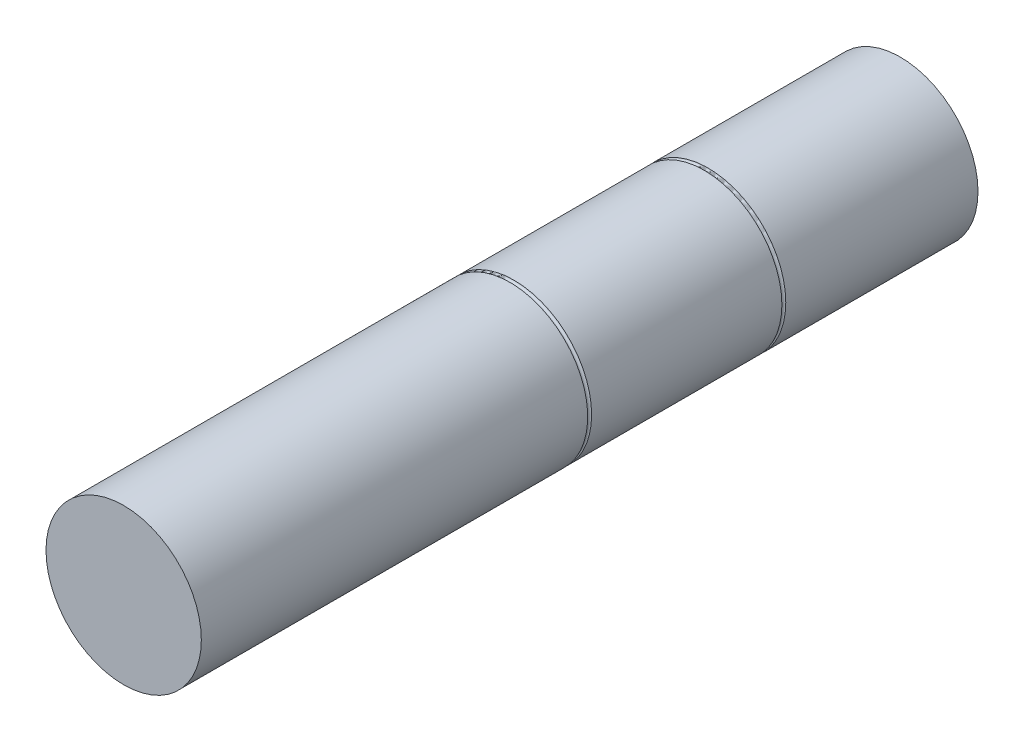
ISO-10303-21;
HEADER;
FILE_DESCRIPTION(('STEP AP214'),'2;1');
FILE_NAME('part.step','',(''),(''),'','','');
FILE_SCHEMA(('AUTOMOTIVE_DESIGN { 1 0 10303 214 1 1 1 1 }'));
ENDSEC;
DATA;
#1=APPLICATION_CONTEXT('core data for automotive mechanical design processes');
#2=APPLICATION_PROTOCOL_DEFINITION('international standard','automotive_design',2000,#1);
#3=PRODUCT_CONTEXT('',#1,'mechanical');
#4=PRODUCT('Part','Part','',(#3));
#5=PRODUCT_RELATED_PRODUCT_CATEGORY('part','',(#4));
#6=PRODUCT_DEFINITION_FORMATION('','',#4);
#7=PRODUCT_DEFINITION_CONTEXT('part definition',#1,'design');
#8=PRODUCT_DEFINITION('design','',#6,#7);
#9=PRODUCT_DEFINITION_SHAPE('','',#8);
#10=(LENGTH_UNIT() NAMED_UNIT(*) SI_UNIT(.MILLI.,.METRE.));
#11=(NAMED_UNIT(*) PLANE_ANGLE_UNIT() SI_UNIT($,.RADIAN.));
#12=(NAMED_UNIT(*) SI_UNIT($,.STERADIAN.) SOLID_ANGLE_UNIT());
#13=UNCERTAINTY_MEASURE_WITH_UNIT(LENGTH_MEASURE(1.E-05),#10,'distance_accuracy_value','');
#14=(GEOMETRIC_REPRESENTATION_CONTEXT(3) GLOBAL_UNCERTAINTY_ASSIGNED_CONTEXT((#13)) GLOBAL_UNIT_ASSIGNED_CONTEXT((#10,
#11,#12)) REPRESENTATION_CONTEXT('',''));
#15=CARTESIAN_POINT('',(0.,0.,0.));
#16=DIRECTION('',(0.,0.,1.));
#17=DIRECTION('',(1.,0.,0.));
#18=AXIS2_PLACEMENT_3D('',#15,#16,#17);
#19=CARTESIAN_POINT('',(0.,0.,100.));
#20=DIRECTION('',(0.,0.,-1.));
#21=DIRECTION('',(-1.,0.,0.));
#22=AXIS2_PLACEMENT_3D('',#19,#20,#21);
#23=CYLINDRICAL_SURFACE('',#22,10.);
#24=CARTESIAN_POINT('',(0.,0.,49.75));
#25=DIRECTION('',(0.,0.,1.));
#26=DIRECTION('',(1.,0.,0.));
#27=AXIS2_PLACEMENT_3D('',#24,#25,#26);
#28=CIRCLE('',#27,10.);
#29=CARTESIAN_POINT('',(10.,0.,49.75));
#30=VERTEX_POINT('',#29);
#31=EDGE_CURVE('E51',#30,#30,#28,.F.);
#32=ORIENTED_EDGE('',*,*,#31,.T.);
#33=EDGE_LOOP('',(#32));
#34=FACE_BOUND('',#33,.T.);
#35=CARTESIAN_POINT('',(0.,0.,25.25));
#36=DIRECTION('',(0.,0.,-1.));
#37=DIRECTION('',(-1.,0.,0.));
#38=AXIS2_PLACEMENT_3D('',#35,#36,#37);
#39=CIRCLE('',#38,10.);
#40=CARTESIAN_POINT('',(-10.,0.,25.25));
#41=VERTEX_POINT('',#40);
#42=EDGE_CURVE('E44',#41,#41,#39,.F.);
#43=ORIENTED_EDGE('',*,*,#42,.T.);
#44=EDGE_LOOP('',(#43));
#45=FACE_BOUND('',#44,.T.);
#46=ADVANCED_FACE('F31',(#34,#45),#23,.T.);
#47=CARTESIAN_POINT('',(0.,0.,25.));
#48=DIRECTION('',(0.,0.,1.));
#49=DIRECTION('',(1.,0.,0.));
#50=AXIS2_PLACEMENT_3D('',#47,#48,#49);
#51=TOROIDAL_SURFACE('',#50,10.,0.25);
#52=CARTESIAN_POINT('',(0.,0.,24.75));
#53=DIRECTION('',(0.,0.,1.));
#54=DIRECTION('',(1.,0.,0.));
#55=AXIS2_PLACEMENT_3D('',#52,#53,#54);
#56=CIRCLE('',#55,10.);
#57=CARTESIAN_POINT('',(10.,0.,24.75));
#58=VERTEX_POINT('',#57);
#59=EDGE_CURVE('E47',#58,#58,#56,.F.);
#60=ORIENTED_EDGE('',*,*,#59,.F.);
#61=EDGE_LOOP('',(#60));
#62=FACE_BOUND('',#61,.T.);
#63=ORIENTED_EDGE('',*,*,#42,.F.);
#64=EDGE_LOOP('',(#63));
#65=FACE_BOUND('',#64,.T.);
#66=ADVANCED_FACE('F75',(#62,#65),#51,.F.);
#67=CARTESIAN_POINT('',(0.,0.,0.));
#68=DIRECTION('',(0.,0.,1.));
#69=DIRECTION('',(1.,0.,0.));
#70=AXIS2_PLACEMENT_3D('',#67,#68,#69);
#71=PLANE('',#70);
#72=CARTESIAN_POINT('',(0.,0.,0.));
#73=DIRECTION('',(0.,0.,1.));
#74=DIRECTION('',(1.,0.,0.));
#75=AXIS2_PLACEMENT_3D('',#72,#73,#74);
#76=CIRCLE('',#75,10.);
#77=CARTESIAN_POINT('',(10.,0.,0.));
#78=VERTEX_POINT('',#77);
#79=EDGE_CURVE('E39',#78,#78,#76,.T.);
#80=ORIENTED_EDGE('',*,*,#79,.F.);
#81=EDGE_LOOP('',(#80));
#82=FACE_BOUND('',#81,.T.);
#83=ADVANCED_FACE('F71',(#82),#71,.F.);
#84=ORIENTED_EDGE('',*,*,#59,.T.);
#85=EDGE_LOOP('',(#84));
#86=FACE_BOUND('',#85,.T.);
#87=ORIENTED_EDGE('',*,*,#79,.T.);
#88=EDGE_LOOP('',(#87));
#89=FACE_BOUND('',#88,.T.);
#90=ADVANCED_FACE('F33',(#86,#89),#23,.T.);
#91=CARTESIAN_POINT('',(0.,0.,50.));
#92=DIRECTION('',(0.,0.,1.));
#93=DIRECTION('',(1.,0.,0.));
#94=AXIS2_PLACEMENT_3D('',#91,#92,#93);
#95=TOROIDAL_SURFACE('',#94,10.,0.25);
#96=ORIENTED_EDGE('',*,*,#31,.F.);
#97=EDGE_LOOP('',(#96));
#98=FACE_BOUND('',#97,.T.);
#99=CARTESIAN_POINT('',(0.,0.,50.25));
#100=DIRECTION('',(0.,0.,-1.));
#101=DIRECTION('',(-1.,0.,0.));
#102=AXIS2_PLACEMENT_3D('',#99,#100,#101);
#103=CIRCLE('',#102,10.);
#104=CARTESIAN_POINT('',(-10.,0.,50.25));
#105=VERTEX_POINT('',#104);
#106=EDGE_CURVE('E35',#105,#105,#103,.F.);
#107=ORIENTED_EDGE('',*,*,#106,.F.);
#108=EDGE_LOOP('',(#107));
#109=FACE_BOUND('',#108,.T.);
#110=ADVANCED_FACE('F61',(#98,#109),#95,.F.);
#111=CARTESIAN_POINT('',(0.,0.,100.));
#112=DIRECTION('',(0.,0.,1.));
#113=DIRECTION('',(1.,0.,0.));
#114=AXIS2_PLACEMENT_3D('',#111,#112,#113);
#115=PLANE('',#114);
#116=CARTESIAN_POINT('',(0.,0.,100.));
#117=DIRECTION('',(0.,0.,1.));
#118=DIRECTION('',(1.,0.,0.));
#119=AXIS2_PLACEMENT_3D('',#116,#117,#118);
#120=CIRCLE('',#119,10.);
#121=CARTESIAN_POINT('',(10.,0.,100.));
#122=VERTEX_POINT('',#121);
#123=EDGE_CURVE('E10',#122,#122,#120,.T.);
#124=ORIENTED_EDGE('',*,*,#123,.T.);
#125=EDGE_LOOP('',(#124));
#126=FACE_BOUND('',#125,.T.);
#127=ADVANCED_FACE('F63',(#126),#115,.T.);
#128=ORIENTED_EDGE('',*,*,#106,.T.);
#129=EDGE_LOOP('',(#128));
#130=FACE_BOUND('',#129,.T.);
#131=ORIENTED_EDGE('',*,*,#123,.F.);
#132=EDGE_LOOP('',(#131));
#133=FACE_BOUND('',#132,.T.);
#134=ADVANCED_FACE('F58',(#130,#133),#23,.T.);
#135=CLOSED_SHELL('',(#46,#66,#83,#90,#110,#127,#134));
#136=MANIFOLD_SOLID_BREP('B2',#135);
#137=ADVANCED_BREP_SHAPE_REPRESENTATION('',(#18,#136),#14);
#138=SHAPE_DEFINITION_REPRESENTATION(#9,#137);
ENDSEC;
END-ISO-10303-21;
